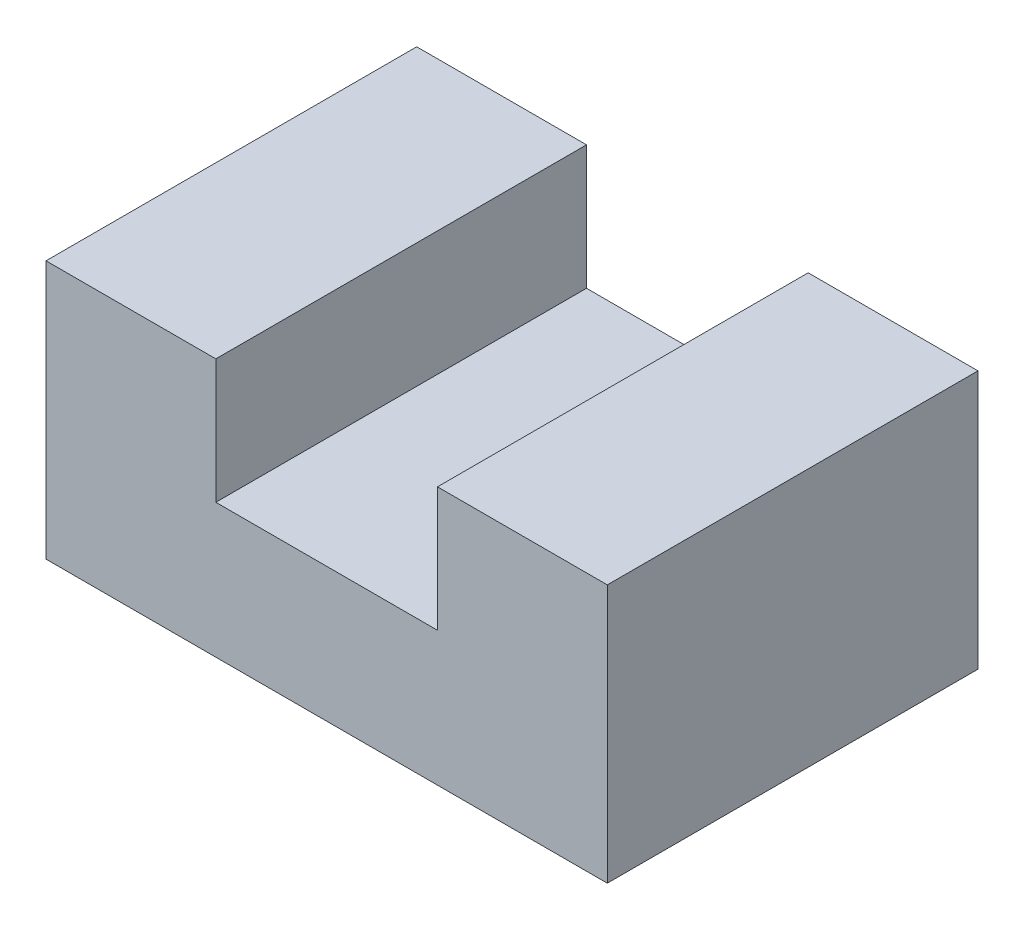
ISO-10303-21;
HEADER;
FILE_DESCRIPTION(('STEP AP214'),'2;1');
FILE_NAME('part.step','',(''),(''),'','','');
FILE_SCHEMA(('AUTOMOTIVE_DESIGN { 1 0 10303 214 1 1 1 1 }'));
ENDSEC;
DATA;
#1=APPLICATION_CONTEXT('core data for automotive mechanical design processes');
#2=APPLICATION_PROTOCOL_DEFINITION('international standard','automotive_design',2000,#1);
#3=PRODUCT_CONTEXT('',#1,'mechanical');
#4=PRODUCT('Part','Part','',(#3));
#5=PRODUCT_RELATED_PRODUCT_CATEGORY('part','',(#4));
#6=PRODUCT_DEFINITION_FORMATION('','',#4);
#7=PRODUCT_DEFINITION_CONTEXT('part definition',#1,'design');
#8=PRODUCT_DEFINITION('design','',#6,#7);
#9=PRODUCT_DEFINITION_SHAPE('','',#8);
#10=(LENGTH_UNIT() NAMED_UNIT(*) SI_UNIT(.MILLI.,.METRE.));
#11=(NAMED_UNIT(*) PLANE_ANGLE_UNIT() SI_UNIT($,.RADIAN.));
#12=(NAMED_UNIT(*) SI_UNIT($,.STERADIAN.) SOLID_ANGLE_UNIT());
#13=UNCERTAINTY_MEASURE_WITH_UNIT(LENGTH_MEASURE(1.E-05),#10,'distance_accuracy_value','');
#14=(GEOMETRIC_REPRESENTATION_CONTEXT(3) GLOBAL_UNCERTAINTY_ASSIGNED_CONTEXT((#13)) GLOBAL_UNIT_ASSIGNED_CONTEXT((#10,
#11,#12)) REPRESENTATION_CONTEXT('',''));
#15=CARTESIAN_POINT('',(0.,0.,0.));
#16=DIRECTION('',(0.,0.,1.));
#17=DIRECTION('',(1.,0.,0.));
#18=AXIS2_PLACEMENT_3D('',#15,#16,#17);
#19=CARTESIAN_POINT('',(83.2796380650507,0.,55.));
#20=DIRECTION('',(-1.,0.,0.));
#21=DIRECTION('',(0.,0.,1.));
#22=AXIS2_PLACEMENT_3D('',#19,#20,#21);
#23=PLANE('',#22);
#24=DIRECTION('',(0.,1.,0.));
#25=VECTOR('',#24,1.);
#26=CARTESIAN_POINT('',(83.2796380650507,0.,-55.));
#27=LINE('',#26,#25);
#28=CARTESIAN_POINT('',(83.2796380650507,0.,-55.));
#29=VERTEX_POINT('',#28);
#30=CARTESIAN_POINT('',(83.2796380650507,76.6708039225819,-55.));
#31=VERTEX_POINT('',#30);
#32=EDGE_CURVE('E128',#29,#31,#27,.T.);
#33=ORIENTED_EDGE('',*,*,#32,.T.);
#34=DIRECTION('',(0.,0.,-1.));
#35=VECTOR('',#34,1.);
#36=CARTESIAN_POINT('',(83.2796380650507,76.6708039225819,55.));
#37=LINE('',#36,#35);
#38=CARTESIAN_POINT('',(83.2796380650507,76.6708039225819,55.));
#39=VERTEX_POINT('',#38);
#40=EDGE_CURVE('E11',#39,#31,#37,.T.);
#41=ORIENTED_EDGE('',*,*,#40,.F.);
#42=DIRECTION('',(0.,1.,0.));
#43=VECTOR('',#42,1.);
#44=CARTESIAN_POINT('',(83.2796380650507,0.,55.));
#45=LINE('',#44,#43);
#46=CARTESIAN_POINT('',(83.2796380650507,0.,55.));
#47=VERTEX_POINT('',#46);
#48=EDGE_CURVE('E142',#47,#39,#45,.T.);
#49=ORIENTED_EDGE('',*,*,#48,.F.);
#50=DIRECTION('',(0.,0.,-1.));
#51=VECTOR('',#50,1.);
#52=CARTESIAN_POINT('',(83.2796380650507,0.,55.));
#53=LINE('',#52,#51);
#54=EDGE_CURVE('E124',#47,#29,#53,.T.);
#55=ORIENTED_EDGE('',*,*,#54,.T.);
#56=EDGE_LOOP('',(#33,#41,#49,#55));
#57=FACE_BOUND('',#56,.T.);
#58=ADVANCED_FACE('F32',(#57),#23,.F.);
#59=CARTESIAN_POINT('',(83.2796380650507,76.6708039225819,55.));
#60=DIRECTION('',(0.,-1.,0.));
#61=DIRECTION('',(0.,0.,-1.));
#62=AXIS2_PLACEMENT_3D('',#59,#60,#61);
#63=PLANE('',#62);
#64=DIRECTION('',(-1.,0.,0.));
#65=VECTOR('',#64,1.);
#66=CARTESIAN_POINT('',(83.2796380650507,76.6708039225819,-55.));
#67=LINE('',#66,#65);
#68=CARTESIAN_POINT('',(32.8883604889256,76.6708039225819,-55.));
#69=VERTEX_POINT('',#68);
#70=EDGE_CURVE('E131',#31,#69,#67,.T.);
#71=ORIENTED_EDGE('',*,*,#70,.T.);
#72=DIRECTION('',(0.,0.,-1.));
#73=VECTOR('',#72,1.);
#74=CARTESIAN_POINT('',(32.8883604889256,76.6708039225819,55.));
#75=LINE('',#74,#73);
#76=CARTESIAN_POINT('',(32.8883604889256,76.6708039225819,55.));
#77=VERTEX_POINT('',#76);
#78=EDGE_CURVE('E40',#77,#69,#75,.T.);
#79=ORIENTED_EDGE('',*,*,#78,.F.);
#80=DIRECTION('',(-1.,0.,0.));
#81=VECTOR('',#80,1.);
#82=CARTESIAN_POINT('',(83.2796380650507,76.6708039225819,55.));
#83=LINE('',#82,#81);
#84=EDGE_CURVE('E91',#39,#77,#83,.T.);
#85=ORIENTED_EDGE('',*,*,#84,.F.);
#86=ORIENTED_EDGE('',*,*,#40,.T.);
#87=EDGE_LOOP('',(#71,#79,#85,#86));
#88=FACE_BOUND('',#87,.T.);
#89=ADVANCED_FACE('F177',(#88),#63,.F.);
#90=CARTESIAN_POINT('',(32.8883604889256,76.6708039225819,55.));
#91=DIRECTION('',(1.,0.,0.));
#92=DIRECTION('',(0.,0.,-1.));
#93=AXIS2_PLACEMENT_3D('',#90,#91,#92);
#94=PLANE('',#93);
#95=DIRECTION('',(0.,-1.,0.));
#96=VECTOR('',#95,1.);
#97=CARTESIAN_POINT('',(32.8883604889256,76.6708039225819,-55.));
#98=LINE('',#97,#96);
#99=CARTESIAN_POINT('',(32.8883604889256,39.8068875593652,-55.));
#100=VERTEX_POINT('',#99);
#101=EDGE_CURVE('E133',#69,#100,#98,.T.);
#102=ORIENTED_EDGE('',*,*,#101,.T.);
#103=DIRECTION('',(0.,0.,-1.));
#104=VECTOR('',#103,1.);
#105=CARTESIAN_POINT('',(32.8883604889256,39.8068875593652,55.));
#106=LINE('',#105,#104);
#107=CARTESIAN_POINT('',(32.8883604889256,39.8068875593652,55.));
#108=VERTEX_POINT('',#107);
#109=EDGE_CURVE('E149',#108,#100,#106,.T.);
#110=ORIENTED_EDGE('',*,*,#109,.F.);
#111=DIRECTION('',(0.,-1.,0.));
#112=VECTOR('',#111,1.);
#113=CARTESIAN_POINT('',(32.8883604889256,76.6708039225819,55.));
#114=LINE('',#113,#112);
#115=EDGE_CURVE('E157',#77,#108,#114,.T.);
#116=ORIENTED_EDGE('',*,*,#115,.F.);
#117=ORIENTED_EDGE('',*,*,#78,.T.);
#118=EDGE_LOOP('',(#102,#110,#116,#117));
#119=FACE_BOUND('',#118,.T.);
#120=ADVANCED_FACE('F155',(#119),#94,.F.);
#121=CARTESIAN_POINT('',(32.8883604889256,39.8068875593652,55.));
#122=DIRECTION('',(0.,-1.,0.));
#123=DIRECTION('',(0.,0.,-1.));
#124=AXIS2_PLACEMENT_3D('',#121,#122,#123);
#125=PLANE('',#124);
#126=DIRECTION('',(-1.,0.,0.));
#127=VECTOR('',#126,1.);
#128=CARTESIAN_POINT('',(32.8883604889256,39.8068875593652,-55.));
#129=LINE('',#128,#127);
#130=CARTESIAN_POINT('',(-32.8883604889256,39.8068875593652,-55.));
#131=VERTEX_POINT('',#130);
#132=EDGE_CURVE('E135',#100,#131,#129,.T.);
#133=ORIENTED_EDGE('',*,*,#132,.T.);
#134=DIRECTION('',(0.,0.,-1.));
#135=VECTOR('',#134,1.);
#136=CARTESIAN_POINT('',(-32.8883604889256,39.8068875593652,55.));
#137=LINE('',#136,#135);
#138=CARTESIAN_POINT('',(-32.8883604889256,39.8068875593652,55.));
#139=VERTEX_POINT('',#138);
#140=EDGE_CURVE('E146',#139,#131,#137,.T.);
#141=ORIENTED_EDGE('',*,*,#140,.F.);
#142=DIRECTION('',(-1.,0.,0.));
#143=VECTOR('',#142,1.);
#144=CARTESIAN_POINT('',(32.8883604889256,39.8068875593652,55.));
#145=LINE('',#144,#143);
#146=EDGE_CURVE('E169',#108,#139,#145,.T.);
#147=ORIENTED_EDGE('',*,*,#146,.F.);
#148=ORIENTED_EDGE('',*,*,#109,.T.);
#149=EDGE_LOOP('',(#133,#141,#147,#148));
#150=FACE_BOUND('',#149,.T.);
#151=ADVANCED_FACE('F165',(#150),#125,.F.);
#152=CARTESIAN_POINT('',(-32.8883604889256,76.6708039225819,55.));
#153=DIRECTION('',(-1.,0.,0.));
#154=DIRECTION('',(0.,0.,1.));
#155=AXIS2_PLACEMENT_3D('',#152,#153,#154);
#156=PLANE('',#155);
#157=DIRECTION('',(0.,1.,0.));
#158=VECTOR('',#157,1.);
#159=CARTESIAN_POINT('',(-32.8883604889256,76.6708039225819,-55.));
#160=LINE('',#159,#158);
#161=CARTESIAN_POINT('',(-32.8883604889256,76.6708039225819,-55.));
#162=VERTEX_POINT('',#161);
#163=EDGE_CURVE('E137',#131,#162,#160,.T.);
#164=ORIENTED_EDGE('',*,*,#163,.T.);
#165=DIRECTION('',(0.,0.,-1.));
#166=VECTOR('',#165,1.);
#167=CARTESIAN_POINT('',(-32.8883604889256,76.6708039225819,55.));
#168=LINE('',#167,#166);
#169=CARTESIAN_POINT('',(-32.8883604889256,76.6708039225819,55.));
#170=VERTEX_POINT('',#169);
#171=EDGE_CURVE('E119',#170,#162,#168,.T.);
#172=ORIENTED_EDGE('',*,*,#171,.F.);
#173=DIRECTION('',(0.,1.,0.));
#174=VECTOR('',#173,1.);
#175=CARTESIAN_POINT('',(-32.8883604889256,76.6708039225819,55.));
#176=LINE('',#175,#174);
#177=EDGE_CURVE('E110',#139,#170,#176,.T.);
#178=ORIENTED_EDGE('',*,*,#177,.F.);
#179=ORIENTED_EDGE('',*,*,#140,.T.);
#180=EDGE_LOOP('',(#164,#172,#178,#179));
#181=FACE_BOUND('',#180,.T.);
#182=ADVANCED_FACE('F168',(#181),#156,.F.);
#183=CARTESIAN_POINT('',(-83.2796380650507,76.6708039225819,55.));
#184=DIRECTION('',(0.,-1.,0.));
#185=DIRECTION('',(0.,0.,-1.));
#186=AXIS2_PLACEMENT_3D('',#183,#184,#185);
#187=PLANE('',#186);
#188=DIRECTION('',(-1.,0.,0.));
#189=VECTOR('',#188,1.);
#190=CARTESIAN_POINT('',(-83.2796380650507,76.6708039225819,-55.));
#191=LINE('',#190,#189);
#192=CARTESIAN_POINT('',(-83.2796380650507,76.6708039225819,-55.));
#193=VERTEX_POINT('',#192);
#194=EDGE_CURVE('E118',#162,#193,#191,.T.);
#195=ORIENTED_EDGE('',*,*,#194,.T.);
#196=DIRECTION('',(0.,0.,-1.));
#197=VECTOR('',#196,1.);
#198=CARTESIAN_POINT('',(-83.2796380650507,76.6708039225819,55.));
#199=LINE('',#198,#197);
#200=CARTESIAN_POINT('',(-83.2796380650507,76.6708039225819,55.));
#201=VERTEX_POINT('',#200);
#202=EDGE_CURVE('E115',#201,#193,#199,.T.);
#203=ORIENTED_EDGE('',*,*,#202,.F.);
#204=DIRECTION('',(-1.,0.,0.));
#205=VECTOR('',#204,1.);
#206=CARTESIAN_POINT('',(-83.2796380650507,76.6708039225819,55.));
#207=LINE('',#206,#205);
#208=EDGE_CURVE('E104',#170,#201,#207,.T.);
#209=ORIENTED_EDGE('',*,*,#208,.F.);
#210=ORIENTED_EDGE('',*,*,#171,.T.);
#211=EDGE_LOOP('',(#195,#203,#209,#210));
#212=FACE_BOUND('',#211,.T.);
#213=ADVANCED_FACE('F116',(#212),#187,.F.);
#214=CARTESIAN_POINT('',(-83.2796380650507,0.,55.));
#215=DIRECTION('',(1.,0.,0.));
#216=DIRECTION('',(0.,0.,-1.));
#217=AXIS2_PLACEMENT_3D('',#214,#215,#216);
#218=PLANE('',#217);
#219=DIRECTION('',(0.,-1.,0.));
#220=VECTOR('',#219,1.);
#221=CARTESIAN_POINT('',(-83.2796380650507,0.,-55.));
#222=LINE('',#221,#220);
#223=CARTESIAN_POINT('',(-83.2796380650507,0.,-55.));
#224=VERTEX_POINT('',#223);
#225=EDGE_CURVE('E77',#193,#224,#222,.T.);
#226=ORIENTED_EDGE('',*,*,#225,.T.);
#227=DIRECTION('',(0.,0.,-1.));
#228=VECTOR('',#227,1.);
#229=CARTESIAN_POINT('',(-83.2796380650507,0.,55.));
#230=LINE('',#229,#228);
#231=CARTESIAN_POINT('',(-83.2796380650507,0.,55.));
#232=VERTEX_POINT('',#231);
#233=EDGE_CURVE('E120',#232,#224,#230,.T.);
#234=ORIENTED_EDGE('',*,*,#233,.F.);
#235=DIRECTION('',(0.,-1.,0.));
#236=VECTOR('',#235,1.);
#237=CARTESIAN_POINT('',(-83.2796380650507,0.,55.));
#238=LINE('',#237,#236);
#239=EDGE_CURVE('E108',#201,#232,#238,.T.);
#240=ORIENTED_EDGE('',*,*,#239,.F.);
#241=ORIENTED_EDGE('',*,*,#202,.T.);
#242=EDGE_LOOP('',(#226,#234,#240,#241));
#243=FACE_BOUND('',#242,.T.);
#244=ADVANCED_FACE('F122',(#243),#218,.F.);
#245=CARTESIAN_POINT('',(-83.2796380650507,0.,55.));
#246=DIRECTION('',(0.,1.,0.));
#247=DIRECTION('',(0.,0.,1.));
#248=AXIS2_PLACEMENT_3D('',#245,#246,#247);
#249=PLANE('',#248);
#250=DIRECTION('',(1.,0.,0.));
#251=VECTOR('',#250,1.);
#252=CARTESIAN_POINT('',(-83.2796380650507,0.,-55.));
#253=LINE('',#252,#251);
#254=EDGE_CURVE('E83',#224,#29,#253,.T.);
#255=ORIENTED_EDGE('',*,*,#254,.T.);
#256=ORIENTED_EDGE('',*,*,#54,.F.);
#257=DIRECTION('',(1.,0.,0.));
#258=VECTOR('',#257,1.);
#259=CARTESIAN_POINT('',(-83.2796380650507,0.,55.));
#260=LINE('',#259,#258);
#261=EDGE_CURVE('E48',#232,#47,#260,.T.);
#262=ORIENTED_EDGE('',*,*,#261,.F.);
#263=ORIENTED_EDGE('',*,*,#233,.T.);
#264=EDGE_LOOP('',(#255,#256,#262,#263));
#265=FACE_BOUND('',#264,.T.);
#266=ADVANCED_FACE('F193',(#265),#249,.F.);
#267=CARTESIAN_POINT('',(83.2796380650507,76.6708039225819,55.));
#268=DIRECTION('',(0.,0.,1.));
#269=DIRECTION('',(1.,0.,0.));
#270=AXIS2_PLACEMENT_3D('',#267,#268,#269);
#271=PLANE('',#270);
#272=ORIENTED_EDGE('',*,*,#48,.T.);
#273=ORIENTED_EDGE('',*,*,#84,.T.);
#274=ORIENTED_EDGE('',*,*,#115,.T.);
#275=ORIENTED_EDGE('',*,*,#146,.T.);
#276=ORIENTED_EDGE('',*,*,#177,.T.);
#277=ORIENTED_EDGE('',*,*,#208,.T.);
#278=ORIENTED_EDGE('',*,*,#239,.T.);
#279=ORIENTED_EDGE('',*,*,#261,.T.);
#280=EDGE_LOOP('',(#272,#273,#274,#275,#276,#277,#278,#279));
#281=FACE_BOUND('',#280,.T.);
#282=ADVANCED_FACE('F106',(#281),#271,.T.);
#283=CARTESIAN_POINT('',(83.2796380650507,76.6708039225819,-55.));
#284=DIRECTION('',(0.,0.,1.));
#285=DIRECTION('',(1.,0.,0.));
#286=AXIS2_PLACEMENT_3D('',#283,#284,#285);
#287=PLANE('',#286);
#288=ORIENTED_EDGE('',*,*,#32,.F.);
#289=ORIENTED_EDGE('',*,*,#254,.F.);
#290=ORIENTED_EDGE('',*,*,#225,.F.);
#291=ORIENTED_EDGE('',*,*,#194,.F.);
#292=ORIENTED_EDGE('',*,*,#163,.F.);
#293=ORIENTED_EDGE('',*,*,#132,.F.);
#294=ORIENTED_EDGE('',*,*,#101,.F.);
#295=ORIENTED_EDGE('',*,*,#70,.F.);
#296=EDGE_LOOP('',(#288,#289,#290,#291,#292,#293,#294,#295));
#297=FACE_BOUND('',#296,.T.);
#298=ADVANCED_FACE('F161',(#297),#287,.F.);
#299=CLOSED_SHELL('',(#58,#89,#120,#151,#182,#213,#244,#266,#282,#298));
#300=MANIFOLD_SOLID_BREP('B2',#299);
#301=ADVANCED_BREP_SHAPE_REPRESENTATION('',(#18,#300),#14);
#302=SHAPE_DEFINITION_REPRESENTATION(#9,#301);
ENDSEC;
END-ISO-10303-21;
